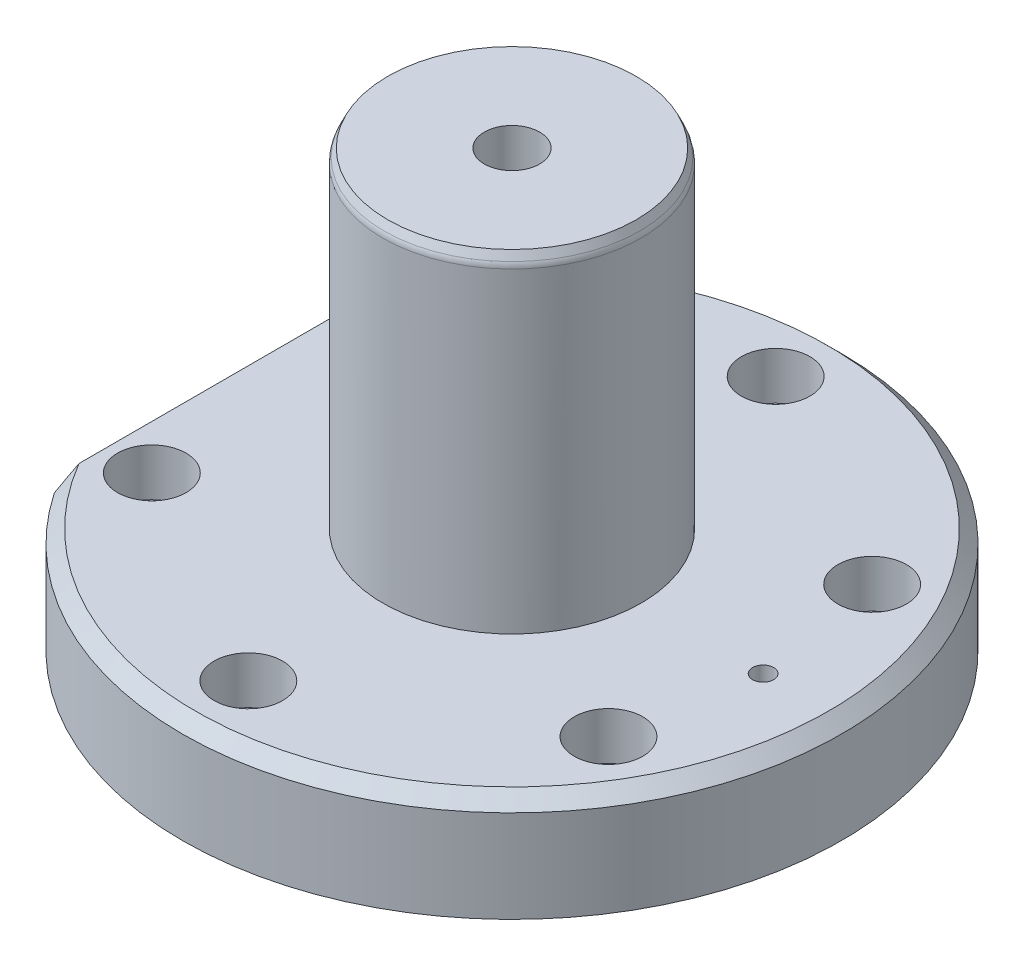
ISO-10303-21;
HEADER;
FILE_DESCRIPTION(('STEP AP214'),'2;1');
FILE_NAME('part.step','',(''),(''),'','','');
FILE_SCHEMA(('AUTOMOTIVE_DESIGN { 1 0 10303 214 1 1 1 1 }'));
ENDSEC;
DATA;
#1=APPLICATION_CONTEXT('core data for automotive mechanical design processes');
#2=APPLICATION_PROTOCOL_DEFINITION('international standard','automotive_design',2000,#1);
#3=PRODUCT_CONTEXT('',#1,'mechanical');
#4=PRODUCT('Part','Part','',(#3));
#5=PRODUCT_RELATED_PRODUCT_CATEGORY('part','',(#4));
#6=PRODUCT_DEFINITION_FORMATION('','',#4);
#7=PRODUCT_DEFINITION_CONTEXT('part definition',#1,'design');
#8=PRODUCT_DEFINITION('design','',#6,#7);
#9=PRODUCT_DEFINITION_SHAPE('','',#8);
#10=(LENGTH_UNIT() NAMED_UNIT(*) SI_UNIT(.MILLI.,.METRE.));
#11=(NAMED_UNIT(*) PLANE_ANGLE_UNIT() SI_UNIT($,.RADIAN.));
#12=(NAMED_UNIT(*) SI_UNIT($,.STERADIAN.) SOLID_ANGLE_UNIT());
#13=UNCERTAINTY_MEASURE_WITH_UNIT(LENGTH_MEASURE(1.E-05),#10,'distance_accuracy_value','');
#14=(GEOMETRIC_REPRESENTATION_CONTEXT(3) GLOBAL_UNCERTAINTY_ASSIGNED_CONTEXT((#13)) GLOBAL_UNIT_ASSIGNED_CONTEXT((#10,
#11,#12)) REPRESENTATION_CONTEXT('',''));
#15=CARTESIAN_POINT('',(0.,0.,0.));
#16=DIRECTION('',(0.,0.,1.));
#17=DIRECTION('',(1.,0.,0.));
#18=AXIS2_PLACEMENT_3D('',#15,#16,#17);
#19=CARTESIAN_POINT('',(0.,0.,0.));
#20=DIRECTION('',(0.,-1.,0.));
#21=DIRECTION('',(0.,0.,-1.));
#22=AXIS2_PLACEMENT_3D('',#19,#20,#21);
#23=CYLINDRICAL_SURFACE('',#22,125.);
#24=CARTESIAN_POINT('',(0.,50.,0.));
#25=DIRECTION('',(0.,-1.,0.));
#26=DIRECTION('',(0.,0.,-1.));
#27=AXIS2_PLACEMENT_3D('',#24,#25,#26);
#28=CIRCLE('',#27,125.);
#29=CARTESIAN_POINT('',(-103.5,50.,-70.0910122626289));
#30=VERTEX_POINT('',#29);
#31=CARTESIAN_POINT('',(-103.5,50.,70.0910122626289));
#32=VERTEX_POINT('',#31);
#33=EDGE_CURVE('E81',#30,#32,#28,.T.);
#34=ORIENTED_EDGE('',*,*,#33,.F.);
#35=DIRECTION('',(0.,-1.,0.));
#36=VECTOR('',#35,1.);
#37=CARTESIAN_POINT('',(-103.5,0.,-70.0910122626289));
#38=LINE('',#37,#36);
#39=CARTESIAN_POINT('',(-103.5,85.0000000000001,-70.0910122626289));
#40=VERTEX_POINT('',#39);
#41=EDGE_CURVE('E66',#30,#40,#38,.F.);
#42=ORIENTED_EDGE('',*,*,#41,.T.);
#43=CARTESIAN_POINT('',(0.,85.0000000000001,0.));
#44=DIRECTION('',(0.,1.,0.));
#45=DIRECTION('',(0.,0.,1.));
#46=AXIS2_PLACEMENT_3D('',#43,#44,#45);
#47=CIRCLE('',#46,125.);
#48=CARTESIAN_POINT('',(-103.5,85.0000000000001,70.0910122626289));
#49=VERTEX_POINT('',#48);
#50=EDGE_CURVE('E89',#40,#49,#47,.F.);
#51=ORIENTED_EDGE('',*,*,#50,.T.);
#52=DIRECTION('',(0.,-1.,0.));
#53=VECTOR('',#52,1.);
#54=CARTESIAN_POINT('',(-103.5,0.,70.0910122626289));
#55=LINE('',#54,#53);
#56=EDGE_CURVE('E48',#32,#49,#55,.F.);
#57=ORIENTED_EDGE('',*,*,#56,.F.);
#58=EDGE_LOOP('',(#34,#42,#51,#57));
#59=FACE_BOUND('',#58,.T.);
#60=ADVANCED_FACE('F33',(#59),#23,.T.);
#61=CARTESIAN_POINT('',(15.,50.,0.));
#62=DIRECTION('',(0.,-1.,0.));
#63=DIRECTION('',(0.,0.,-1.));
#64=AXIS2_PLACEMENT_3D('',#61,#62,#63);
#65=PLANE('',#64);
#66=CARTESIAN_POINT('',(86.6025403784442,50.,49.9999999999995));
#67=DIRECTION('',(0.,-1.,0.));
#68=DIRECTION('',(0.,0.,-1.));
#69=AXIS2_PLACEMENT_3D('',#66,#67,#68);
#70=CIRCLE('',#69,8.75);
#71=CARTESIAN_POINT('',(86.6025403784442,50.,41.2499999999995));
#72=VERTEX_POINT('',#71);
#73=EDGE_CURVE('E131',#72,#72,#70,.T.);
#74=ORIENTED_EDGE('',*,*,#73,.F.);
#75=EDGE_LOOP('',(#74));
#76=FACE_BOUND('',#75,.T.);
#77=CARTESIAN_POINT('',(-86.6025403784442,50.,49.9999999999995));
#78=DIRECTION('',(0.,-1.,0.));
#79=DIRECTION('',(0.,0.,-1.));
#80=AXIS2_PLACEMENT_3D('',#77,#78,#79);
#81=CIRCLE('',#80,8.75);
#82=CARTESIAN_POINT('',(-86.6025403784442,50.,41.2499999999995));
#83=VERTEX_POINT('',#82);
#84=EDGE_CURVE('E126',#83,#83,#81,.T.);
#85=ORIENTED_EDGE('',*,*,#84,.F.);
#86=EDGE_LOOP('',(#85));
#87=FACE_BOUND('',#86,.T.);
#88=CARTESIAN_POINT('',(-86.6025403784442,50.,-49.9999999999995));
#89=DIRECTION('',(0.,-1.,0.));
#90=DIRECTION('',(0.,0.,-1.));
#91=AXIS2_PLACEMENT_3D('',#88,#89,#90);
#92=CIRCLE('',#91,8.75);
#93=CARTESIAN_POINT('',(-86.6025403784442,50.,-58.7499999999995));
#94=VERTEX_POINT('',#93);
#95=EDGE_CURVE('E121',#94,#94,#92,.T.);
#96=ORIENTED_EDGE('',*,*,#95,.F.);
#97=EDGE_LOOP('',(#96));
#98=FACE_BOUND('',#97,.T.);
#99=CARTESIAN_POINT('',(86.6025403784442,50.,-49.9999999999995));
#100=DIRECTION('',(0.,-1.,0.));
#101=DIRECTION('',(0.,0.,-1.));
#102=AXIS2_PLACEMENT_3D('',#99,#100,#101);
#103=CIRCLE('',#102,8.75);
#104=CARTESIAN_POINT('',(86.6025403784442,50.,-58.7499999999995));
#105=VERTEX_POINT('',#104);
#106=EDGE_CURVE('E116',#105,#105,#103,.T.);
#107=ORIENTED_EDGE('',*,*,#106,.F.);
#108=EDGE_LOOP('',(#107));
#109=FACE_BOUND('',#108,.T.);
#110=CARTESIAN_POINT('',(0.,50.,-100.));
#111=DIRECTION('',(0.,-1.,0.));
#112=DIRECTION('',(0.,0.,-1.));
#113=AXIS2_PLACEMENT_3D('',#110,#111,#112);
#114=CIRCLE('',#113,8.75);
#115=CARTESIAN_POINT('',(0.,50.,-108.75));
#116=VERTEX_POINT('',#115);
#117=EDGE_CURVE('E111',#116,#116,#114,.T.);
#118=ORIENTED_EDGE('',*,*,#117,.F.);
#119=EDGE_LOOP('',(#118));
#120=FACE_BOUND('',#119,.T.);
#121=CARTESIAN_POINT('',(0.,50.,100.));
#122=DIRECTION('',(0.,-1.,0.));
#123=DIRECTION('',(0.,0.,-1.));
#124=AXIS2_PLACEMENT_3D('',#121,#122,#123);
#125=CIRCLE('',#124,8.75);
#126=CARTESIAN_POINT('',(0.,50.,91.25));
#127=VERTEX_POINT('',#126);
#128=EDGE_CURVE('E106',#127,#127,#125,.T.);
#129=ORIENTED_EDGE('',*,*,#128,.F.);
#130=EDGE_LOOP('',(#129));
#131=FACE_BOUND('',#130,.T.);
#132=CARTESIAN_POINT('',(95.25,50.,0.));
#133=DIRECTION('',(0.,-1.,0.));
#134=DIRECTION('',(0.,0.,-1.));
#135=AXIS2_PLACEMENT_3D('',#132,#133,#134);
#136=CIRCLE('',#135,3.99999999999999);
#137=CARTESIAN_POINT('',(95.25,50.,-3.99999999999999));
#138=VERTEX_POINT('',#137);
#139=EDGE_CURVE('E226',#138,#138,#136,.T.);
#140=ORIENTED_EDGE('',*,*,#139,.F.);
#141=EDGE_LOOP('',(#140));
#142=FACE_BOUND('',#141,.T.);
#143=CARTESIAN_POINT('',(0.,50.,0.));
#144=DIRECTION('',(0.,-1.,0.));
#145=DIRECTION('',(0.,0.,-1.));
#146=AXIS2_PLACEMENT_3D('',#143,#144,#145);
#147=CIRCLE('',#146,15.);
#148=CARTESIAN_POINT('',(0.,50.,-15.));
#149=VERTEX_POINT('',#148);
#150=EDGE_CURVE('E86',#149,#149,#147,.T.);
#151=ORIENTED_EDGE('',*,*,#150,.F.);
#152=EDGE_LOOP('',(#151));
#153=FACE_BOUND('',#152,.T.);
#154=ORIENTED_EDGE('',*,*,#33,.T.);
#155=DIRECTION('',(0.,0.,-1.));
#156=VECTOR('',#155,1.);
#157=CARTESIAN_POINT('',(-103.5,50.,125.001));
#158=LINE('',#157,#156);
#159=EDGE_CURVE('E69',#32,#30,#158,.T.);
#160=ORIENTED_EDGE('',*,*,#159,.T.);
#161=EDGE_LOOP('',(#154,#160));
#162=FACE_BOUND('',#161,.T.);
#163=ADVANCED_FACE('F80',(#76,#87,#98,#109,#120,#131,#142,#153,#162),#65,.T.);
#164=CARTESIAN_POINT('',(48.9999999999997,90.,0.));
#165=DIRECTION('',(0.,1.,0.));
#166=DIRECTION('',(0.,0.,1.));
#167=AXIS2_PLACEMENT_3D('',#164,#165,#166);
#168=PLANE('',#167);
#169=CARTESIAN_POINT('',(86.6025403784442,90.,49.9999999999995));
#170=DIRECTION('',(0.,1.,0.));
#171=DIRECTION('',(0.,0.,1.));
#172=AXIS2_PLACEMENT_3D('',#169,#170,#171);
#173=CIRCLE('',#172,13.);
#174=CARTESIAN_POINT('',(86.6025403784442,90.,62.9999999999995));
#175=VERTEX_POINT('',#174);
#176=EDGE_CURVE('E312',#175,#175,#173,.T.);
#177=ORIENTED_EDGE('',*,*,#176,.F.);
#178=EDGE_LOOP('',(#177));
#179=FACE_BOUND('',#178,.T.);
#180=CARTESIAN_POINT('',(-86.6025403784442,90.,49.9999999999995));
#181=DIRECTION('',(0.,1.,0.));
#182=DIRECTION('',(0.,0.,1.));
#183=AXIS2_PLACEMENT_3D('',#180,#181,#182);
#184=CIRCLE('',#183,13.);
#185=CARTESIAN_POINT('',(-86.6025403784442,90.,62.9999999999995));
#186=VERTEX_POINT('',#185);
#187=EDGE_CURVE('E133',#186,#186,#184,.T.);
#188=ORIENTED_EDGE('',*,*,#187,.F.);
#189=EDGE_LOOP('',(#188));
#190=FACE_BOUND('',#189,.T.);
#191=CARTESIAN_POINT('',(-86.6025403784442,90.,-49.9999999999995));
#192=DIRECTION('',(0.,1.,0.));
#193=DIRECTION('',(0.,0.,1.));
#194=AXIS2_PLACEMENT_3D('',#191,#192,#193);
#195=CIRCLE('',#194,13.);
#196=CARTESIAN_POINT('',(-86.6025403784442,90.,-36.9999999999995));
#197=VERTEX_POINT('',#196);
#198=EDGE_CURVE('E129',#197,#197,#195,.T.);
#199=ORIENTED_EDGE('',*,*,#198,.F.);
#200=EDGE_LOOP('',(#199));
#201=FACE_BOUND('',#200,.T.);
#202=CARTESIAN_POINT('',(86.6025403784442,90.,-49.9999999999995));
#203=DIRECTION('',(0.,1.,0.));
#204=DIRECTION('',(0.,0.,1.));
#205=AXIS2_PLACEMENT_3D('',#202,#203,#204);
#206=CIRCLE('',#205,13.);
#207=CARTESIAN_POINT('',(86.6025403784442,90.,-36.9999999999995));
#208=VERTEX_POINT('',#207);
#209=EDGE_CURVE('E124',#208,#208,#206,.T.);
#210=ORIENTED_EDGE('',*,*,#209,.F.);
#211=EDGE_LOOP('',(#210));
#212=FACE_BOUND('',#211,.T.);
#213=CARTESIAN_POINT('',(0.,90.,-100.));
#214=DIRECTION('',(0.,1.,0.));
#215=DIRECTION('',(0.,0.,1.));
#216=AXIS2_PLACEMENT_3D('',#213,#214,#215);
#217=CIRCLE('',#216,13.);
#218=CARTESIAN_POINT('',(0.,90.,-87.));
#219=VERTEX_POINT('',#218);
#220=EDGE_CURVE('E119',#219,#219,#217,.T.);
#221=ORIENTED_EDGE('',*,*,#220,.F.);
#222=EDGE_LOOP('',(#221));
#223=FACE_BOUND('',#222,.T.);
#224=CARTESIAN_POINT('',(0.,90.,100.));
#225=DIRECTION('',(0.,1.,0.));
#226=DIRECTION('',(0.,0.,1.));
#227=AXIS2_PLACEMENT_3D('',#224,#225,#226);
#228=CIRCLE('',#227,13.);
#229=CARTESIAN_POINT('',(0.,90.,113.));
#230=VERTEX_POINT('',#229);
#231=EDGE_CURVE('E114',#230,#230,#228,.T.);
#232=ORIENTED_EDGE('',*,*,#231,.F.);
#233=EDGE_LOOP('',(#232));
#234=FACE_BOUND('',#233,.T.);
#235=CARTESIAN_POINT('',(95.25,90.,0.));
#236=DIRECTION('',(0.,1.,0.));
#237=DIRECTION('',(0.,0.,1.));
#238=AXIS2_PLACEMENT_3D('',#235,#236,#237);
#239=CIRCLE('',#238,3.99999999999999);
#240=CARTESIAN_POINT('',(95.25,90.,3.99999999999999));
#241=VERTEX_POINT('',#240);
#242=EDGE_CURVE('E109',#241,#241,#239,.T.);
#243=ORIENTED_EDGE('',*,*,#242,.F.);
#244=EDGE_LOOP('',(#243));
#245=FACE_BOUND('',#244,.T.);
#246=CARTESIAN_POINT('',(0.,90.,0.));
#247=DIRECTION('',(0.,-1.,0.));
#248=DIRECTION('',(0.,0.,-1.));
#249=AXIS2_PLACEMENT_3D('',#246,#247,#248);
#250=CIRCLE('',#249,48.9999999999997);
#251=CARTESIAN_POINT('',(0.,90.,-48.9999999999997));
#252=VERTEX_POINT('',#251);
#253=EDGE_CURVE('E92',#252,#252,#250,.T.);
#254=ORIENTED_EDGE('',*,*,#253,.T.);
#255=EDGE_LOOP('',(#254));
#256=FACE_BOUND('',#255,.T.);
#257=CARTESIAN_POINT('',(0.,90.,0.));
#258=DIRECTION('',(0.,1.,0.));
#259=DIRECTION('',(0.,0.,1.));
#260=AXIS2_PLACEMENT_3D('',#257,#258,#259);
#261=CIRCLE('',#260,120.);
#262=CARTESIAN_POINT('',(-103.5,90.,60.7268474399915));
#263=VERTEX_POINT('',#262);
#264=CARTESIAN_POINT('',(-103.5,90.,-60.7268474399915));
#265=VERTEX_POINT('',#264);
#266=EDGE_CURVE('E97',#263,#265,#261,.T.);
#267=ORIENTED_EDGE('',*,*,#266,.T.);
#268=DIRECTION('',(0.,0.,-1.));
#269=VECTOR('',#268,1.);
#270=CARTESIAN_POINT('',(-103.5,90.,125.001));
#271=LINE('',#270,#269);
#272=EDGE_CURVE('E83',#263,#265,#271,.T.);
#273=ORIENTED_EDGE('',*,*,#272,.F.);
#274=EDGE_LOOP('',(#267,#273));
#275=FACE_BOUND('',#274,.T.);
#276=ADVANCED_FACE('F156',(#179,#190,#201,#212,#223,#234,#245,#256,#275),#168,.T.);
#277=CARTESIAN_POINT('',(0.,85.0000000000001,0.));
#278=DIRECTION('',(0.,-1.,0.));
#279=DIRECTION('',(0.,0.,-1.));
#280=AXIS2_PLACEMENT_3D('',#277,#278,#279);
#281=CONICAL_SURFACE('',#280,125.,0.785398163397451);
#282=ORIENTED_EDGE('',*,*,#50,.F.);
#283=CARTESIAN_POINT('',(-103.5,9.93982398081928,-171.206962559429));
#284=CARTESIAN_POINT('',(-103.5,11.0354276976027,-169.926714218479));
#285=CARTESIAN_POINT('',(-103.5,12.1291371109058,-168.644845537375));
#286=CARTESIAN_POINT('',(-103.5,14.3125241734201,-166.07767532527));
#287=CARTESIAN_POINT('',(-103.5,15.4022018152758,-164.792373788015));
#288=CARTESIAN_POINT('',(-103.5,18.6648538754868,-160.930994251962));
#289=CARTESIAN_POINT('',(-103.5,20.8314096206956,-158.349485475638));
#290=CARTESIAN_POINT('',(-103.5,25.146214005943,-153.168953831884));
#291=CARTESIAN_POINT('',(-103.5,27.2944526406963,-150.569922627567));
#292=CARTESIAN_POINT('',(-103.5,31.5687519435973,-145.35369083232));
#293=CARTESIAN_POINT('',(-103.5,33.6948127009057,-142.736490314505));
#294=CARTESIAN_POINT('',(-103.5,37.9796856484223,-137.409287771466));
#295=CARTESIAN_POINT('',(-103.5,40.1377882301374,-134.698714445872));
#296=CARTESIAN_POINT('',(-103.5,44.4228928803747,-129.25305512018));
#297=CARTESIAN_POINT('',(-103.5,46.5498948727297,-126.517969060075));
#298=CARTESIAN_POINT('',(-103.5,50.7670802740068,-121.020582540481));
#299=CARTESIAN_POINT('',(-103.5,52.8572724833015,-118.25828883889));
#300=CARTESIAN_POINT('',(-103.5,56.9950266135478,-112.701873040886));
#301=CARTESIAN_POINT('',(-103.5,59.0425885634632,-109.9077509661));
#302=CARTESIAN_POINT('',(-103.5,62.0777978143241,-105.686726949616));
#303=CARTESIAN_POINT('',(-103.5,63.0844116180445,-104.27344553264));
#304=CARTESIAN_POINT('',(-103.5,65.0837435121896,-101.437093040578));
#305=CARTESIAN_POINT('',(-103.5,66.0764617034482,-100.014022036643));
#306=CARTESIAN_POINT('',(-103.5,68.0467250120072,-97.157356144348));
#307=CARTESIAN_POINT('',(-103.5,69.0242697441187,-95.7237609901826));
#308=CARTESIAN_POINT('',(-103.5,70.9626776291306,-92.8453500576));
#309=CARTESIAN_POINT('',(-103.5,71.9235409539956,-91.4005343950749));
#310=CARTESIAN_POINT('',(-103.5,73.8278097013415,-88.4975524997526));
#311=CARTESIAN_POINT('',(-103.5,74.7711984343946,-87.0393753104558));
#312=CARTESIAN_POINT('',(-103.5,76.6377542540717,-84.1101227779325));
#313=CARTESIAN_POINT('',(-103.5,77.5609213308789,-82.6390474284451));
#314=CARTESIAN_POINT('',(-103.5,79.3849245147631,-79.6831260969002));
#315=CARTESIAN_POINT('',(-103.5,80.2857608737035,-78.1982802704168));
#316=CARTESIAN_POINT('',(-103.5,82.0627504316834,-75.2138757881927));
#317=CARTESIAN_POINT('',(-103.5,82.9389036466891,-73.7143171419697));
#318=CARTESIAN_POINT('',(-103.5,84.6550490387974,-70.7149488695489));
#319=CARTESIAN_POINT('',(-103.5,85.4953193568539,-69.2152985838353));
#320=CARTESIAN_POINT('',(-103.5,87.1461793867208,-66.1997232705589));
#321=CARTESIAN_POINT('',(-103.5,87.956769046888,-64.6837982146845));
#322=CARTESIAN_POINT('',(-103.5,89.5451369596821,-61.6345519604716));
#323=CARTESIAN_POINT('',(-103.5,90.3229105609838,-60.1012283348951));
#324=CARTESIAN_POINT('',(-103.5,91.8418990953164,-57.0165660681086));
#325=CARTESIAN_POINT('',(-103.5,92.5831142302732,-55.4652275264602));
#326=CARTESIAN_POINT('',(-103.5,94.0238514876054,-52.3462211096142));
#327=CARTESIAN_POINT('',(-103.5,94.7234379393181,-50.7785830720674));
#328=CARTESIAN_POINT('',(-103.5,96.0777628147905,-47.6241078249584));
#329=CARTESIAN_POINT('',(-103.5,96.7325002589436,-46.0372701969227));
#330=CARTESIAN_POINT('',(-103.5,98.6219493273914,-41.2482988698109));
#331=CARTESIAN_POINT('',(-103.5,99.7826483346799,-38.0161033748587));
#332=CARTESIAN_POINT('',(-103.5,101.358924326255,-33.0632521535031));
#333=CARTESIAN_POINT('',(-103.5,101.862735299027,-31.370324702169));
#334=CARTESIAN_POINT('',(-103.5,102.800982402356,-27.9652841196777));
#335=CARTESIAN_POINT('',(-103.5,103.23542196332,-26.2531719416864));
#336=CARTESIAN_POINT('',(-103.5,104.029154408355,-22.8116878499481));
#337=CARTESIAN_POINT('',(-103.5,104.388452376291,-21.0823171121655));
#338=CARTESIAN_POINT('',(-103.5,105.026656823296,-17.6087184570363));
#339=CARTESIAN_POINT('',(-103.5,105.305562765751,-15.864490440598));
#340=CARTESIAN_POINT('',(-103.5,105.777466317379,-12.3720248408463));
#341=CARTESIAN_POINT('',(-103.5,105.970827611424,-10.6238366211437));
#342=CARTESIAN_POINT('',(-103.5,106.270075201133,-7.11996410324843));
#343=CARTESIAN_POINT('',(-103.5,106.375962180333,-5.36427986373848));
#344=CARTESIAN_POINT('',(-103.5,106.498366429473,-1.84985549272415));
#345=CARTESIAN_POINT('',(-103.5,106.514887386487,-0.0911154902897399));
#346=CARTESIAN_POINT('',(-103.5,106.458268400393,3.42491585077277));
#347=CARTESIAN_POINT('',(-103.5,106.385128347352,5.18220718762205));
#348=CARTESIAN_POINT('',(-103.5,106.150865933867,8.68551417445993));
#349=CARTESIAN_POINT('',(-103.5,105.990011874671,10.4315478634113));
#350=CARTESIAN_POINT('',(-103.5,105.583290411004,13.9136430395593));
#351=CARTESIAN_POINT('',(-103.5,105.337422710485,15.6497044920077));
#352=CARTESIAN_POINT('',(-103.5,104.764649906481,19.1086027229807));
#353=CARTESIAN_POINT('',(-103.5,104.437733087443,20.8314375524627));
#354=CARTESIAN_POINT('',(-103.5,103.707802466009,24.2608467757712));
#355=CARTESIAN_POINT('',(-103.5,103.304788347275,25.9674211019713));
#356=CARTESIAN_POINT('',(-103.5,102.4247034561,29.3756078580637));
#357=CARTESIAN_POINT('',(-103.5,101.947075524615,31.0770758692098));
#358=CARTESIAN_POINT('',(-103.5,100.925940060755,34.4601453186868));
#359=CARTESIAN_POINT('',(-103.5,100.38242919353,36.1417457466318));
#360=CARTESIAN_POINT('',(-103.5,99.2354635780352,39.4841306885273));
#361=CARTESIAN_POINT('',(-103.5,98.6320147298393,41.1449172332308));
#362=CARTESIAN_POINT('',(-103.5,97.370798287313,44.4456183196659));
#363=CARTESIAN_POINT('',(-103.5,96.7130317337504,46.0855332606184));
#364=CARTESIAN_POINT('',(-103.5,95.0356924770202,50.0919391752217));
#365=CARTESIAN_POINT('',(-103.5,93.9884913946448,52.4468747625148));
#366=CARTESIAN_POINT('',(-103.5,91.8049605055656,57.1145562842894));
#367=CARTESIAN_POINT('',(-103.5,90.6686393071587,59.4273062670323));
#368=CARTESIAN_POINT('',(-103.5,88.9154848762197,62.8502215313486));
#369=CARTESIAN_POINT('',(-103.5,88.3275312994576,63.975300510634));
#370=CARTESIAN_POINT('',(-103.5,87.1344186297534,66.2163195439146));
#371=CARTESIAN_POINT('',(-103.5,86.5292594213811,67.3322595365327));
#372=CARTESIAN_POINT('',(-103.5,85.3031627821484,69.5550907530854));
#373=CARTESIAN_POINT('',(-103.5,84.682228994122,70.6619839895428));
#374=CARTESIAN_POINT('',(-103.5,83.4256114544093,72.8673163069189));
#375=CARTESIAN_POINT('',(-103.5,82.7899282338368,73.9657556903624));
#376=CARTESIAN_POINT('',(-103.5,82.1474285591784,75.0601760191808));
#377=B_SPLINE_CURVE_WITH_KNOTS('',3,(#283,#284,#285,#286,#287,#288,#289,#290,#291,#292,#293,
#294,#295,#296,#297,#298,#299,#300,#301,#302,#303,#304,#305,#306,#307,#308,#309,#310,#311,#312,
#313,#314,#315,#316,#317,#318,#319,#320,#321,#322,#323,#324,#325,#326,#327,#328,#329,#330,#331,
#332,#333,#334,#335,#336,#337,#338,#339,#340,#341,#342,#343,#344,#345,#346,#347,#348,#349,#350,
#351,#352,#353,#354,#355,#356,#357,#358,#359,#360,#361,#362,#363,#364,#365,#366,#367,#368,#369,
#370,#371,#372,#373,#374,#375,#376),.UNSPECIFIED.,.F.,.F.,(4,2,2,2,2,2,2,2,2,2,2,2,2,2,2,2,2,2,
2,2,2,2,2,2,2,2,2,2,2,2,2,2,2,2,2,2,2,2,2,2,2,2,2,2,2,2,4),(0.,5.05513739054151,
10.1102839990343,20.2207515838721,30.336427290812,40.4520623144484,50.8461702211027,
61.2403035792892,71.6319172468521,82.0235238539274,87.2288110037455,92.434060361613,
97.639441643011,102.844769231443,108.054835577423,113.264904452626,118.474914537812,
123.684921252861,128.841656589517,133.998400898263,139.155873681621,144.313317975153,
149.462573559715,154.611941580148,164.905374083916,170.203122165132,175.500608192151,
180.797735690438,186.094898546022,191.369319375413,196.643698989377,201.917860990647,
207.192029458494,212.450154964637,217.708298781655,222.96720310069,228.226129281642,
233.526388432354,238.826915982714,244.126922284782,249.426827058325,257.156355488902,
264.885138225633,268.6933547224,272.501596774,276.308967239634,280.116200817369),.UNSPECIFIED.);
#378=EDGE_CURVE('E71',#40,#265,#377,.T.);
#379=ORIENTED_EDGE('',*,*,#378,.T.);
#380=ORIENTED_EDGE('',*,*,#266,.F.);
#381=CARTESIAN_POINT('',(-103.5,9.93982398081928,171.206962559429));
#382=CARTESIAN_POINT('',(-103.5,11.0354276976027,169.926714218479));
#383=CARTESIAN_POINT('',(-103.5,12.1291371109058,168.644845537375));
#384=CARTESIAN_POINT('',(-103.5,14.3125241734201,166.07767532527));
#385=CARTESIAN_POINT('',(-103.5,15.4022018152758,164.792373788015));
#386=CARTESIAN_POINT('',(-103.5,18.6648538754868,160.930994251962));
#387=CARTESIAN_POINT('',(-103.5,20.8314096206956,158.349485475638));
#388=CARTESIAN_POINT('',(-103.5,25.146214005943,153.168953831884));
#389=CARTESIAN_POINT('',(-103.5,27.2944526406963,150.569922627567));
#390=CARTESIAN_POINT('',(-103.5,31.5687519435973,145.35369083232));
#391=CARTESIAN_POINT('',(-103.5,33.6948127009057,142.736490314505));
#392=CARTESIAN_POINT('',(-103.5,37.9796856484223,137.409287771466));
#393=CARTESIAN_POINT('',(-103.5,40.1377882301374,134.698714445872));
#394=CARTESIAN_POINT('',(-103.5,44.4228928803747,129.25305512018));
#395=CARTESIAN_POINT('',(-103.5,46.5498948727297,126.517969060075));
#396=CARTESIAN_POINT('',(-103.5,50.7670802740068,121.020582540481));
#397=CARTESIAN_POINT('',(-103.5,52.8572724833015,118.25828883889));
#398=CARTESIAN_POINT('',(-103.5,56.9950266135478,112.701873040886));
#399=CARTESIAN_POINT('',(-103.5,59.0425885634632,109.9077509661));
#400=CARTESIAN_POINT('',(-103.5,62.0777978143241,105.686726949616));
#401=CARTESIAN_POINT('',(-103.5,63.0844116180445,104.27344553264));
#402=CARTESIAN_POINT('',(-103.5,65.0837435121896,101.437093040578));
#403=CARTESIAN_POINT('',(-103.5,66.0764617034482,100.014022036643));
#404=CARTESIAN_POINT('',(-103.5,68.0467250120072,97.157356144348));
#405=CARTESIAN_POINT('',(-103.5,69.0242697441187,95.7237609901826));
#406=CARTESIAN_POINT('',(-103.5,70.9626776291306,92.8453500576));
#407=CARTESIAN_POINT('',(-103.5,71.9235409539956,91.4005343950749));
#408=CARTESIAN_POINT('',(-103.5,73.8278097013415,88.4975524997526));
#409=CARTESIAN_POINT('',(-103.5,74.7711984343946,87.0393753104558));
#410=CARTESIAN_POINT('',(-103.5,76.6377542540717,84.1101227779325));
#411=CARTESIAN_POINT('',(-103.5,77.5609213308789,82.6390474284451));
#412=CARTESIAN_POINT('',(-103.5,79.3849245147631,79.6831260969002));
#413=CARTESIAN_POINT('',(-103.5,80.2857608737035,78.1982802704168));
#414=CARTESIAN_POINT('',(-103.5,82.0627504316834,75.2138757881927));
#415=CARTESIAN_POINT('',(-103.5,82.9389036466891,73.7143171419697));
#416=CARTESIAN_POINT('',(-103.5,84.6550490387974,70.7149488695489));
#417=CARTESIAN_POINT('',(-103.5,85.4953193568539,69.2152985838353));
#418=CARTESIAN_POINT('',(-103.5,87.1461793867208,66.1997232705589));
#419=CARTESIAN_POINT('',(-103.5,87.956769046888,64.6837982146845));
#420=CARTESIAN_POINT('',(-103.5,89.5451369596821,61.6345519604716));
#421=CARTESIAN_POINT('',(-103.5,90.3229105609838,60.1012283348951));
#422=CARTESIAN_POINT('',(-103.5,91.8418990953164,57.0165660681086));
#423=CARTESIAN_POINT('',(-103.5,92.5831142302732,55.4652275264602));
#424=CARTESIAN_POINT('',(-103.5,94.0238514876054,52.3462211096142));
#425=CARTESIAN_POINT('',(-103.5,94.7234379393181,50.7785830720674));
#426=CARTESIAN_POINT('',(-103.5,96.0777628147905,47.6241078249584));
#427=CARTESIAN_POINT('',(-103.5,96.7325002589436,46.0372701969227));
#428=CARTESIAN_POINT('',(-103.5,98.6219493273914,41.2482988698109));
#429=CARTESIAN_POINT('',(-103.5,99.7826483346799,38.0161033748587));
#430=CARTESIAN_POINT('',(-103.5,101.358924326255,33.0632521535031));
#431=CARTESIAN_POINT('',(-103.5,101.862735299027,31.370324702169));
#432=CARTESIAN_POINT('',(-103.5,102.800982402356,27.9652841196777));
#433=CARTESIAN_POINT('',(-103.5,103.23542196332,26.2531719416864));
#434=CARTESIAN_POINT('',(-103.5,104.029154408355,22.8116878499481));
#435=CARTESIAN_POINT('',(-103.5,104.388452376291,21.0823171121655));
#436=CARTESIAN_POINT('',(-103.5,105.026656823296,17.6087184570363));
#437=CARTESIAN_POINT('',(-103.5,105.305562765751,15.864490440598));
#438=CARTESIAN_POINT('',(-103.5,105.777466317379,12.3720248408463));
#439=CARTESIAN_POINT('',(-103.5,105.970827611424,10.6238366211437));
#440=CARTESIAN_POINT('',(-103.5,106.270075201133,7.11996410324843));
#441=CARTESIAN_POINT('',(-103.5,106.375962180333,5.36427986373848));
#442=CARTESIAN_POINT('',(-103.5,106.498366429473,1.84985549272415));
#443=CARTESIAN_POINT('',(-103.5,106.514887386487,0.0911154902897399));
#444=CARTESIAN_POINT('',(-103.5,106.458268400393,-3.42491585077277));
#445=CARTESIAN_POINT('',(-103.5,106.385128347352,-5.18220718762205));
#446=CARTESIAN_POINT('',(-103.5,106.150865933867,-8.68551417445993));
#447=CARTESIAN_POINT('',(-103.5,105.990011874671,-10.4315478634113));
#448=CARTESIAN_POINT('',(-103.5,105.583290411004,-13.9136430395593));
#449=CARTESIAN_POINT('',(-103.5,105.337422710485,-15.6497044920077));
#450=CARTESIAN_POINT('',(-103.5,104.764649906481,-19.1086027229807));
#451=CARTESIAN_POINT('',(-103.5,104.437733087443,-20.8314375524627));
#452=CARTESIAN_POINT('',(-103.5,103.707802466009,-24.2608467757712));
#453=CARTESIAN_POINT('',(-103.5,103.304788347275,-25.9674211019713));
#454=CARTESIAN_POINT('',(-103.5,102.4247034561,-29.3756078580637));
#455=CARTESIAN_POINT('',(-103.5,101.947075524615,-31.0770758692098));
#456=CARTESIAN_POINT('',(-103.5,100.925940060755,-34.4601453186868));
#457=CARTESIAN_POINT('',(-103.5,100.38242919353,-36.1417457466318));
#458=CARTESIAN_POINT('',(-103.5,99.2354635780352,-39.4841306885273));
#459=CARTESIAN_POINT('',(-103.5,98.6320147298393,-41.1449172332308));
#460=CARTESIAN_POINT('',(-103.5,97.370798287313,-44.4456183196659));
#461=CARTESIAN_POINT('',(-103.5,96.7130317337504,-46.0855332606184));
#462=CARTESIAN_POINT('',(-103.5,95.0356924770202,-50.0919391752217));
#463=CARTESIAN_POINT('',(-103.5,93.9884913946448,-52.4468747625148));
#464=CARTESIAN_POINT('',(-103.5,91.8049605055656,-57.1145562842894));
#465=CARTESIAN_POINT('',(-103.5,90.6686393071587,-59.4273062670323));
#466=CARTESIAN_POINT('',(-103.5,88.9154848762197,-62.8502215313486));
#467=CARTESIAN_POINT('',(-103.5,88.3275312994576,-63.975300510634));
#468=CARTESIAN_POINT('',(-103.5,87.1344186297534,-66.2163195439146));
#469=CARTESIAN_POINT('',(-103.5,86.5292594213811,-67.3322595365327));
#470=CARTESIAN_POINT('',(-103.5,85.3031627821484,-69.5550907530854));
#471=CARTESIAN_POINT('',(-103.5,84.682228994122,-70.6619839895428));
#472=CARTESIAN_POINT('',(-103.5,83.4256114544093,-72.8673163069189));
#473=CARTESIAN_POINT('',(-103.5,82.7899282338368,-73.9657556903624));
#474=CARTESIAN_POINT('',(-103.5,82.1474285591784,-75.0601760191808));
#475=B_SPLINE_CURVE_WITH_KNOTS('',3,(#381,#382,#383,#384,#385,#386,#387,#388,#389,#390,#391,
#392,#393,#394,#395,#396,#397,#398,#399,#400,#401,#402,#403,#404,#405,#406,#407,#408,#409,#410,
#411,#412,#413,#414,#415,#416,#417,#418,#419,#420,#421,#422,#423,#424,#425,#426,#427,#428,#429,
#430,#431,#432,#433,#434,#435,#436,#437,#438,#439,#440,#441,#442,#443,#444,#445,#446,#447,#448,
#449,#450,#451,#452,#453,#454,#455,#456,#457,#458,#459,#460,#461,#462,#463,#464,#465,#466,#467,
#468,#469,#470,#471,#472,#473,#474),.UNSPECIFIED.,.F.,.F.,(4,2,2,2,2,2,2,2,2,2,2,2,2,2,2,2,2,2,
2,2,2,2,2,2,2,2,2,2,2,2,2,2,2,2,2,2,2,2,2,2,2,2,2,2,2,2,4),(0.,5.05513739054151,
10.1102839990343,20.2207515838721,30.336427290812,40.4520623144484,50.8461702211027,
61.2403035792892,71.6319172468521,82.0235238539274,87.2288110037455,92.434060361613,
97.639441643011,102.844769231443,108.054835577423,113.264904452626,118.474914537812,
123.684921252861,128.841656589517,133.998400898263,139.155873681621,144.313317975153,
149.462573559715,154.611941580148,164.905374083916,170.203122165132,175.500608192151,
180.797735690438,186.094898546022,191.369319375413,196.643698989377,201.917860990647,
207.192029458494,212.450154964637,217.708298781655,222.96720310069,228.226129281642,
233.526388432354,238.826915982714,244.126922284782,249.426827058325,257.156355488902,
264.885138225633,268.6933547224,272.501596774,276.308967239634,280.116200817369),.UNSPECIFIED.);
#476=EDGE_CURVE('E76',#49,#263,#475,.T.);
#477=ORIENTED_EDGE('',*,*,#476,.F.);
#478=EDGE_LOOP('',(#282,#379,#380,#477));
#479=FACE_BOUND('',#478,.T.);
#480=ADVANCED_FACE('F166',(#479),#281,.T.);
#481=CARTESIAN_POINT('',(0.,0.,0.));
#482=DIRECTION('',(0.,-1.,0.));
#483=DIRECTION('',(0.,0.,-1.));
#484=AXIS2_PLACEMENT_3D('',#481,#482,#483);
#485=CYLINDRICAL_SURFACE('',#484,15.);
#486=CARTESIAN_POINT('',(0.,43.0000000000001,0.));
#487=DIRECTION('',(0.,-1.,0.));
#488=DIRECTION('',(0.,0.,-1.));
#489=AXIS2_PLACEMENT_3D('',#486,#487,#488);
#490=CIRCLE('',#489,15.);
#491=CARTESIAN_POINT('',(0.,43.0000000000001,15.));
#492=VERTEX_POINT('',#491);
#493=EDGE_CURVE('E103',#492,#492,#490,.F.);
#494=ORIENTED_EDGE('',*,*,#493,.T.);
#495=EDGE_LOOP('',(#494));
#496=FACE_BOUND('',#495,.T.);
#497=ORIENTED_EDGE('',*,*,#150,.T.);
#498=EDGE_LOOP('',(#497));
#499=FACE_BOUND('',#498,.T.);
#500=ADVANCED_FACE('F168',(#496,#499),#485,.T.);
#501=CARTESIAN_POINT('',(15.,40.,0.));
#502=DIRECTION('',(0.,-1.,0.));
#503=DIRECTION('',(0.,0.,-1.));
#504=AXIS2_PLACEMENT_3D('',#501,#502,#503);
#505=PLANE('',#504);
#506=CARTESIAN_POINT('',(0.,40.,0.));
#507=DIRECTION('',(0.,-1.,0.));
#508=DIRECTION('',(0.,0.,-1.));
#509=AXIS2_PLACEMENT_3D('',#506,#507,#508);
#510=CIRCLE('',#509,13.2679491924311);
#511=CARTESIAN_POINT('',(0.,40.,13.2679491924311));
#512=VERTEX_POINT('',#511);
#513=EDGE_CURVE('E100',#512,#512,#510,.T.);
#514=ORIENTED_EDGE('',*,*,#513,.T.);
#515=EDGE_LOOP('',(#514));
#516=FACE_BOUND('',#515,.T.);
#517=ADVANCED_FACE('F182',(#516),#505,.T.);
#518=CARTESIAN_POINT('',(0.,215.,0.));
#519=DIRECTION('',(0.,1.,0.));
#520=DIRECTION('',(0.,0.,1.));
#521=AXIS2_PLACEMENT_3D('',#518,#519,#520);
#522=PLANE('',#521);
#523=CARTESIAN_POINT('',(0.,215.,0.));
#524=DIRECTION('',(0.,1.,0.));
#525=DIRECTION('',(0.,0.,1.));
#526=AXIS2_PLACEMENT_3D('',#523,#524,#525);
#527=CIRCLE('',#526,10.5);
#528=CARTESIAN_POINT('',(0.,215.,10.5));
#529=VERTEX_POINT('',#528);
#530=EDGE_CURVE('E82',#529,#529,#527,.T.);
#531=ORIENTED_EDGE('',*,*,#530,.F.);
#532=EDGE_LOOP('',(#531));
#533=FACE_BOUND('',#532,.T.);
#534=CARTESIAN_POINT('',(0.,215.,0.));
#535=DIRECTION('',(0.,1.,0.));
#536=DIRECTION('',(0.,0.,1.));
#537=AXIS2_PLACEMENT_3D('',#534,#535,#536);
#538=CIRCLE('',#537,47.1347693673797);
#539=CARTESIAN_POINT('',(0.,215.,47.1347693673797));
#540=VERTEX_POINT('',#539);
#541=EDGE_CURVE('E85',#540,#540,#538,.T.);
#542=ORIENTED_EDGE('',*,*,#541,.T.);
#543=EDGE_LOOP('',(#542));
#544=FACE_BOUND('',#543,.T.);
#545=ADVANCED_FACE('F184',(#533,#544),#522,.T.);
#546=CARTESIAN_POINT('',(0.,0.,0.));
#547=DIRECTION('',(0.,-1.,0.));
#548=DIRECTION('',(0.,0.,-1.));
#549=AXIS2_PLACEMENT_3D('',#546,#547,#548);
#550=CYLINDRICAL_SURFACE('',#549,48.9999999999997);
#551=CARTESIAN_POINT('',(0.,209.891526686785,0.));
#552=DIRECTION('',(0.,1.,0.));
#553=DIRECTION('',(0.,0.,1.));
#554=AXIS2_PLACEMENT_3D('',#551,#552,#553);
#555=CIRCLE('',#554,48.9999999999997);
#556=CARTESIAN_POINT('',(0.,209.891526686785,48.9999999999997));
#557=VERTEX_POINT('',#556);
#558=EDGE_CURVE('E41',#557,#557,#555,.F.);
#559=ORIENTED_EDGE('',*,*,#558,.T.);
#560=EDGE_LOOP('',(#559));
#561=FACE_BOUND('',#560,.T.);
#562=ORIENTED_EDGE('',*,*,#253,.F.);
#563=EDGE_LOOP('',(#562));
#564=FACE_BOUND('',#563,.T.);
#565=ADVANCED_FACE('F138',(#561,#564),#550,.T.);
#566=CARTESIAN_POINT('',(0.,211.,0.));
#567=DIRECTION('',(0.,-1.,0.));
#568=DIRECTION('',(0.,0.,-1.));
#569=AXIS2_PLACEMENT_3D('',#566,#567,#568);
#570=CONICAL_SURFACE('',#569,48.9999999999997,0.436332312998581);
#571=CARTESIAN_POINT('',(0.,212.004617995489,0.));
#572=DIRECTION('',(0.,1.,0.));
#573=DIRECTION('',(0.,0.,1.));
#574=AXIS2_PLACEMENT_3D('',#571,#572,#573);
#575=CIRCLE('',#574,48.531538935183);
#576=CARTESIAN_POINT('',(0.,212.004617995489,48.531538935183));
#577=VERTEX_POINT('',#576);
#578=EDGE_CURVE('E11',#577,#577,#575,.T.);
#579=ORIENTED_EDGE('',*,*,#578,.T.);
#580=EDGE_LOOP('',(#579));
#581=FACE_BOUND('',#580,.T.);
#582=ORIENTED_EDGE('',*,*,#541,.F.);
#583=EDGE_LOOP('',(#582));
#584=FACE_BOUND('',#583,.T.);
#585=ADVANCED_FACE('F161',(#581,#584),#570,.T.);
#586=CARTESIAN_POINT('',(0.,40.,0.));
#587=DIRECTION('',(0.,1.,0.));
#588=DIRECTION('',(0.,0.,1.));
#589=AXIS2_PLACEMENT_3D('',#586,#587,#588);
#590=CONICAL_SURFACE('',#589,13.2679491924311,0.523598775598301);
#591=CARTESIAN_POINT('',(0.,43.0000000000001,15.));
#592=CARTESIAN_POINT('',(0.,42.9687500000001,14.9819578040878));
#593=CARTESIAN_POINT('',(0.,42.9375000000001,14.9639156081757));
#594=CARTESIAN_POINT('',(0.,42.8750000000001,14.9278312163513));
#595=CARTESIAN_POINT('',(0.,42.8437500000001,14.9097890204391));
#596=CARTESIAN_POINT('',(0.,42.7812500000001,14.8737046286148));
#597=CARTESIAN_POINT('',(0.,42.7500000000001,14.8556624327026));
#598=CARTESIAN_POINT('',(0.,42.6875000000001,14.8195780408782));
#599=CARTESIAN_POINT('',(0.,42.6562500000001,14.8015358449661));
#600=CARTESIAN_POINT('',(0.,42.5937500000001,14.7654514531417));
#601=CARTESIAN_POINT('',(0.,42.5625000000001,14.7474092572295));
#602=CARTESIAN_POINT('',(0.,42.5000000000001,14.7113248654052));
#603=CARTESIAN_POINT('',(0.,42.4687500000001,14.693282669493));
#604=CARTESIAN_POINT('',(0.,42.4062500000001,14.6571982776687));
#605=CARTESIAN_POINT('',(0.,42.3750000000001,14.6391560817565));
#606=CARTESIAN_POINT('',(0.,42.3125000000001,14.6030716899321));
#607=CARTESIAN_POINT('',(0.,42.2812500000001,14.5850294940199));
#608=CARTESIAN_POINT('',(0.,42.2187500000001,14.5489451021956));
#609=CARTESIAN_POINT('',(0.,42.1875000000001,14.5309029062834));
#610=CARTESIAN_POINT('',(0.,42.1250000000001,14.4948185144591));
#611=CARTESIAN_POINT('',(0.,42.0937500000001,14.4767763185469));
#612=CARTESIAN_POINT('',(0.,42.0312500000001,14.4406919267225));
#613=CARTESIAN_POINT('',(0.,42.0000000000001,14.4226497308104));
#614=CARTESIAN_POINT('',(0.,41.9375000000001,14.386565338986));
#615=CARTESIAN_POINT('',(0.,41.9062500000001,14.3685231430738));
#616=CARTESIAN_POINT('',(0.,41.8437500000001,14.3324387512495));
#617=CARTESIAN_POINT('',(0.,41.8125000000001,14.3143965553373));
#618=CARTESIAN_POINT('',(0.,41.7500000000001,14.2783121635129));
#619=CARTESIAN_POINT('',(0.,41.7187500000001,14.2602699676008));
#620=CARTESIAN_POINT('',(0.,41.6562500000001,14.2241855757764));
#621=CARTESIAN_POINT('',(0.,41.6250000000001,14.2061433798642));
#622=CARTESIAN_POINT('',(0.,41.5625000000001,14.1700589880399));
#623=CARTESIAN_POINT('',(0.,41.5312500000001,14.1520167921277));
#624=CARTESIAN_POINT('',(0.,41.4687500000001,14.1159324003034));
#625=CARTESIAN_POINT('',(0.,41.4375000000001,14.0978902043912));
#626=CARTESIAN_POINT('',(0.,41.3750000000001,14.0618058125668));
#627=CARTESIAN_POINT('',(0.,41.3437500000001,14.0437636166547));
#628=CARTESIAN_POINT('',(0.,41.2812500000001,14.0076792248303));
#629=CARTESIAN_POINT('',(0.,41.2500000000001,13.9896370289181));
#630=CARTESIAN_POINT('',(0.,41.1875,13.9535526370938));
#631=CARTESIAN_POINT('',(0.,41.1562500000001,13.9355104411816));
#632=CARTESIAN_POINT('',(0.,41.09375,13.8994260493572));
#633=CARTESIAN_POINT('',(0.,41.0625,13.8813838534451));
#634=CARTESIAN_POINT('',(0.,41.,13.8452994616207));
#635=CARTESIAN_POINT('',(0.,40.96875,13.8272572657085));
#636=CARTESIAN_POINT('',(0.,40.90625,13.7911728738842));
#637=CARTESIAN_POINT('',(0.,40.875,13.773130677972));
#638=CARTESIAN_POINT('',(0.,40.8125,13.7370462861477));
#639=CARTESIAN_POINT('',(0.,40.78125,13.7190040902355));
#640=CARTESIAN_POINT('',(0.,40.71875,13.6829196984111));
#641=CARTESIAN_POINT('',(0.,40.6875,13.664877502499));
#642=CARTESIAN_POINT('',(0.,40.625,13.6287931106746));
#643=CARTESIAN_POINT('',(0.,40.59375,13.6107509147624));
#644=CARTESIAN_POINT('',(0.,40.53125,13.5746665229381));
#645=CARTESIAN_POINT('',(0.,40.5,13.5566243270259));
#646=CARTESIAN_POINT('',(0.,40.4375,13.5205399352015));
#647=CARTESIAN_POINT('',(0.,40.40625,13.5024977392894));
#648=CARTESIAN_POINT('',(0.,40.34375,13.466413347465));
#649=CARTESIAN_POINT('',(0.,40.3125,13.4483711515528));
#650=CARTESIAN_POINT('',(0.,40.25,13.4122867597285));
#651=CARTESIAN_POINT('',(0.,40.21875,13.3942445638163));
#652=CARTESIAN_POINT('',(0.,40.15625,13.358160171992));
#653=CARTESIAN_POINT('',(0.,40.125,13.3401179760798));
#654=CARTESIAN_POINT('',(0.,40.0625,13.3040335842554));
#655=CARTESIAN_POINT('',(0.,40.03125,13.2859913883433));
#656=CARTESIAN_POINT('',(0.,40.,13.2679491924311));
#657=B_SPLINE_CURVE_WITH_KNOTS('',3,(#591,#592,#593,#594,#595,#596,#597,#598,#599,#600,#601,
#602,#603,#604,#605,#606,#607,#608,#609,#610,#611,#612,#613,#614,#615,#616,#617,#618,#619,#620,
#621,#622,#623,#624,#625,#626,#627,#628,#629,#630,#631,#632,#633,#634,#635,#636,#637,#638,#639,
#640,#641,#642,#643,#644,#645,#646,#647,#648,#649,#650,#651,#652,#653,#654,#655,#656),
.UNSPECIFIED.,.F.,.F.,(4,2,2,2,2,2,2,2,2,2,2,2,2,2,2,2,2,2,2,2,2,2,2,2,2,2,2,2,2,2,2,2,4),(0.,
0.108253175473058,0.216506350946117,0.324759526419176,0.433012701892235,0.541265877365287,
0.649519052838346,0.757772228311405,0.866025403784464,0.974278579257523,1.08253175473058,
1.19078493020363,1.29903810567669,1.40729128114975,1.51554445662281,1.62379763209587,
1.73205080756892,1.84030398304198,1.94855715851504,2.0568103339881,2.16506350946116,
2.27331668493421,2.38156986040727,2.48982303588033,2.59807621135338,2.70632938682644,
2.8145825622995,2.92283573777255,3.03108891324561,3.13934208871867,3.24759526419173,
3.35584843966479,3.46410161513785),.UNSPECIFIED.);
#658=EDGE_CURVE('BSEAM164',#492,#512,#657,.T.);
#659=ORIENTED_EDGE('',*,*,#493,.F.);
#660=ORIENTED_EDGE('',*,*,#513,.F.);
#661=ORIENTED_EDGE('',*,*,#658,.T.);
#662=ORIENTED_EDGE('',*,*,#658,.F.);
#663=EDGE_LOOP('',(#659,#661,#660,#662));
#664=FACE_BOUND('',#663,.T.);
#665=ADVANCED_FACE('F164',(#664),#590,.T.);
#666=CARTESIAN_POINT('',(0.,152.,0.));
#667=DIRECTION('',(0.,1.,0.));
#668=DIRECTION('',(0.,0.,1.));
#669=AXIS2_PLACEMENT_3D('',#666,#667,#668);
#670=CONICAL_SURFACE('',#669,10.5,1.02974425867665);
#671=CARTESIAN_POINT('',(0.,145.690963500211,0.));
#672=VERTEX_POINT('',#671);
#673=VERTEX_LOOP('',#672);
#674=FACE_BOUND('',#673,.T.);
#675=CARTESIAN_POINT('',(0.,152.,0.));
#676=DIRECTION('',(0.,1.,0.));
#677=DIRECTION('',(0.,0.,1.));
#678=AXIS2_PLACEMENT_3D('',#675,#676,#677);
#679=CIRCLE('',#678,10.5);
#680=CARTESIAN_POINT('',(0.,152.,10.5));
#681=VERTEX_POINT('',#680);
#682=EDGE_CURVE('E218',#681,#681,#679,.T.);
#683=ORIENTED_EDGE('',*,*,#682,.T.);
#684=EDGE_LOOP('',(#683));
#685=FACE_BOUND('',#684,.T.);
#686=ADVANCED_FACE('F171',(#674,#685),#670,.F.);
#687=CARTESIAN_POINT('',(0.,215.,0.));
#688=DIRECTION('',(0.,1.,0.));
#689=DIRECTION('',(0.,0.,1.));
#690=AXIS2_PLACEMENT_3D('',#687,#688,#689);
#691=CYLINDRICAL_SURFACE('',#690,10.5);
#692=ORIENTED_EDGE('',*,*,#682,.F.);
#693=EDGE_LOOP('',(#692));
#694=FACE_BOUND('',#693,.T.);
#695=ORIENTED_EDGE('',*,*,#530,.T.);
#696=EDGE_LOOP('',(#695));
#697=FACE_BOUND('',#696,.T.);
#698=ADVANCED_FACE('F176',(#694,#697),#691,.F.);
#699=CARTESIAN_POINT('',(-103.5,50.,125.001));
#700=DIRECTION('',(-1.,0.,0.));
#701=DIRECTION('',(0.,0.,1.));
#702=AXIS2_PLACEMENT_3D('',#699,#700,#701);
#703=PLANE('',#702);
#704=ORIENTED_EDGE('',*,*,#56,.T.);
#705=ORIENTED_EDGE('',*,*,#476,.T.);
#706=ORIENTED_EDGE('',*,*,#272,.T.);
#707=ORIENTED_EDGE('',*,*,#378,.F.);
#708=ORIENTED_EDGE('',*,*,#41,.F.);
#709=ORIENTED_EDGE('',*,*,#159,.F.);
#710=EDGE_LOOP('',(#704,#705,#706,#707,#708,#709));
#711=FACE_BOUND('',#710,.T.);
#712=ADVANCED_FACE('F68',(#711),#703,.T.);
#713=CARTESIAN_POINT('',(95.25,90.,0.));
#714=DIRECTION('',(0.,1.,0.));
#715=DIRECTION('',(0.,0.,1.));
#716=AXIS2_PLACEMENT_3D('',#713,#714,#715);
#717=CYLINDRICAL_SURFACE('',#716,3.99999999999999);
#718=ORIENTED_EDGE('',*,*,#242,.T.);
#719=EDGE_LOOP('',(#718));
#720=FACE_BOUND('',#719,.T.);
#721=ORIENTED_EDGE('',*,*,#139,.T.);
#722=EDGE_LOOP('',(#721));
#723=FACE_BOUND('',#722,.T.);
#724=ADVANCED_FACE('F205',(#720,#723),#717,.F.);
#725=CARTESIAN_POINT('',(0.,90.,100.));
#726=DIRECTION('',(0.,1.,0.));
#727=DIRECTION('',(0.,0.,1.));
#728=AXIS2_PLACEMENT_3D('',#725,#726,#727);
#729=CYLINDRICAL_SURFACE('',#728,8.75);
#730=ORIENTED_EDGE('',*,*,#128,.T.);
#731=EDGE_LOOP('',(#730));
#732=FACE_BOUND('',#731,.T.);
#733=CARTESIAN_POINT('',(0.,72.,100.));
#734=DIRECTION('',(0.,1.,0.));
#735=DIRECTION('',(0.,0.,1.));
#736=AXIS2_PLACEMENT_3D('',#733,#734,#735);
#737=CIRCLE('',#736,8.75000000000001);
#738=CARTESIAN_POINT('',(0.,72.,108.75));
#739=VERTEX_POINT('',#738);
#740=EDGE_CURVE('E110',#739,#739,#737,.T.);
#741=ORIENTED_EDGE('',*,*,#740,.T.);
#742=EDGE_LOOP('',(#741));
#743=FACE_BOUND('',#742,.T.);
#744=ADVANCED_FACE('F237',(#732,#743),#729,.F.);
#745=CARTESIAN_POINT('',(8.75000000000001,72.,100.));
#746=DIRECTION('',(0.,-1.,0.));
#747=DIRECTION('',(0.,0.,-1.));
#748=AXIS2_PLACEMENT_3D('',#745,#746,#747);
#749=PLANE('',#748);
#750=ORIENTED_EDGE('',*,*,#740,.F.);
#751=EDGE_LOOP('',(#750));
#752=FACE_BOUND('',#751,.T.);
#753=CARTESIAN_POINT('',(0.,72.,100.));
#754=DIRECTION('',(0.,1.,0.));
#755=DIRECTION('',(0.,0.,1.));
#756=AXIS2_PLACEMENT_3D('',#753,#754,#755);
#757=CIRCLE('',#756,13.);
#758=CARTESIAN_POINT('',(0.,72.,113.));
#759=VERTEX_POINT('',#758);
#760=EDGE_CURVE('E348',#759,#759,#757,.T.);
#761=ORIENTED_EDGE('',*,*,#760,.T.);
#762=EDGE_LOOP('',(#761));
#763=FACE_BOUND('',#762,.T.);
#764=ADVANCED_FACE('F241',(#752,#763),#749,.F.);
#765=CARTESIAN_POINT('',(0.,90.,100.));
#766=DIRECTION('',(0.,1.,0.));
#767=DIRECTION('',(0.,0.,1.));
#768=AXIS2_PLACEMENT_3D('',#765,#766,#767);
#769=CYLINDRICAL_SURFACE('',#768,13.);
#770=ORIENTED_EDGE('',*,*,#760,.F.);
#771=EDGE_LOOP('',(#770));
#772=FACE_BOUND('',#771,.T.);
#773=ORIENTED_EDGE('',*,*,#231,.T.);
#774=EDGE_LOOP('',(#773));
#775=FACE_BOUND('',#774,.T.);
#776=ADVANCED_FACE('F245',(#772,#775),#769,.F.);
#777=CARTESIAN_POINT('',(0.,90.,-100.));
#778=DIRECTION('',(0.,1.,0.));
#779=DIRECTION('',(0.,0.,1.));
#780=AXIS2_PLACEMENT_3D('',#777,#778,#779);
#781=CYLINDRICAL_SURFACE('',#780,8.75);
#782=ORIENTED_EDGE('',*,*,#117,.T.);
#783=EDGE_LOOP('',(#782));
#784=FACE_BOUND('',#783,.T.);
#785=CARTESIAN_POINT('',(0.,72.,-100.));
#786=DIRECTION('',(0.,1.,0.));
#787=DIRECTION('',(0.,0.,1.));
#788=AXIS2_PLACEMENT_3D('',#785,#786,#787);
#789=CIRCLE('',#788,8.75000000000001);
#790=CARTESIAN_POINT('',(0.,72.,-91.25));
#791=VERTEX_POINT('',#790);
#792=EDGE_CURVE('E115',#791,#791,#789,.T.);
#793=ORIENTED_EDGE('',*,*,#792,.T.);
#794=EDGE_LOOP('',(#793));
#795=FACE_BOUND('',#794,.T.);
#796=ADVANCED_FACE('F249',(#784,#795),#781,.F.);
#797=CARTESIAN_POINT('',(8.75000000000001,72.,-100.));
#798=DIRECTION('',(0.,-1.,0.));
#799=DIRECTION('',(0.,0.,-1.));
#800=AXIS2_PLACEMENT_3D('',#797,#798,#799);
#801=PLANE('',#800);
#802=ORIENTED_EDGE('',*,*,#792,.F.);
#803=EDGE_LOOP('',(#802));
#804=FACE_BOUND('',#803,.T.);
#805=CARTESIAN_POINT('',(0.,72.,-100.));
#806=DIRECTION('',(0.,1.,0.));
#807=DIRECTION('',(0.,0.,1.));
#808=AXIS2_PLACEMENT_3D('',#805,#806,#807);
#809=CIRCLE('',#808,13.);
#810=CARTESIAN_POINT('',(0.,72.,-87.));
#811=VERTEX_POINT('',#810);
#812=EDGE_CURVE('E341',#811,#811,#809,.T.);
#813=ORIENTED_EDGE('',*,*,#812,.T.);
#814=EDGE_LOOP('',(#813));
#815=FACE_BOUND('',#814,.T.);
#816=ADVANCED_FACE('F253',(#804,#815),#801,.F.);
#817=CARTESIAN_POINT('',(0.,90.,-100.));
#818=DIRECTION('',(0.,1.,0.));
#819=DIRECTION('',(0.,0.,1.));
#820=AXIS2_PLACEMENT_3D('',#817,#818,#819);
#821=CYLINDRICAL_SURFACE('',#820,13.);
#822=ORIENTED_EDGE('',*,*,#812,.F.);
#823=EDGE_LOOP('',(#822));
#824=FACE_BOUND('',#823,.T.);
#825=ORIENTED_EDGE('',*,*,#220,.T.);
#826=EDGE_LOOP('',(#825));
#827=FACE_BOUND('',#826,.T.);
#828=ADVANCED_FACE('F257',(#824,#827),#821,.F.);
#829=CARTESIAN_POINT('',(86.6025403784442,90.,-49.9999999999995));
#830=DIRECTION('',(0.,1.,0.));
#831=DIRECTION('',(0.,0.,1.));
#832=AXIS2_PLACEMENT_3D('',#829,#830,#831);
#833=CYLINDRICAL_SURFACE('',#832,8.75);
#834=ORIENTED_EDGE('',*,*,#106,.T.);
#835=EDGE_LOOP('',(#834));
#836=FACE_BOUND('',#835,.T.);
#837=CARTESIAN_POINT('',(86.6025403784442,72.,-49.9999999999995));
#838=DIRECTION('',(0.,1.,0.));
#839=DIRECTION('',(0.,0.,1.));
#840=AXIS2_PLACEMENT_3D('',#837,#838,#839);
#841=CIRCLE('',#840,8.75000000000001);
#842=CARTESIAN_POINT('',(86.6025403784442,72.,-41.2499999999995));
#843=VERTEX_POINT('',#842);
#844=EDGE_CURVE('E120',#843,#843,#841,.T.);
#845=ORIENTED_EDGE('',*,*,#844,.T.);
#846=EDGE_LOOP('',(#845));
#847=FACE_BOUND('',#846,.T.);
#848=ADVANCED_FACE('F261',(#836,#847),#833,.F.);
#849=CARTESIAN_POINT('',(95.3525403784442,72.,-49.9999999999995));
#850=DIRECTION('',(0.,-1.,0.));
#851=DIRECTION('',(0.,0.,-1.));
#852=AXIS2_PLACEMENT_3D('',#849,#850,#851);
#853=PLANE('',#852);
#854=ORIENTED_EDGE('',*,*,#844,.F.);
#855=EDGE_LOOP('',(#854));
#856=FACE_BOUND('',#855,.T.);
#857=CARTESIAN_POINT('',(86.6025403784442,72.,-49.9999999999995));
#858=DIRECTION('',(0.,1.,0.));
#859=DIRECTION('',(0.,0.,1.));
#860=AXIS2_PLACEMENT_3D('',#857,#858,#859);
#861=CIRCLE('',#860,13.);
#862=CARTESIAN_POINT('',(86.6025403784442,72.,-36.9999999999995));
#863=VERTEX_POINT('',#862);
#864=EDGE_CURVE('E334',#863,#863,#861,.T.);
#865=ORIENTED_EDGE('',*,*,#864,.T.);
#866=EDGE_LOOP('',(#865));
#867=FACE_BOUND('',#866,.T.);
#868=ADVANCED_FACE('F265',(#856,#867),#853,.F.);
#869=CARTESIAN_POINT('',(86.6025403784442,90.,-49.9999999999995));
#870=DIRECTION('',(0.,1.,0.));
#871=DIRECTION('',(0.,0.,1.));
#872=AXIS2_PLACEMENT_3D('',#869,#870,#871);
#873=CYLINDRICAL_SURFACE('',#872,13.);
#874=ORIENTED_EDGE('',*,*,#864,.F.);
#875=EDGE_LOOP('',(#874));
#876=FACE_BOUND('',#875,.T.);
#877=ORIENTED_EDGE('',*,*,#209,.T.);
#878=EDGE_LOOP('',(#877));
#879=FACE_BOUND('',#878,.T.);
#880=ADVANCED_FACE('F269',(#876,#879),#873,.F.);
#881=CARTESIAN_POINT('',(-86.6025403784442,90.,-49.9999999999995));
#882=DIRECTION('',(0.,1.,0.));
#883=DIRECTION('',(0.,0.,1.));
#884=AXIS2_PLACEMENT_3D('',#881,#882,#883);
#885=CYLINDRICAL_SURFACE('',#884,8.75);
#886=ORIENTED_EDGE('',*,*,#95,.T.);
#887=EDGE_LOOP('',(#886));
#888=FACE_BOUND('',#887,.T.);
#889=CARTESIAN_POINT('',(-86.6025403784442,72.,-49.9999999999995));
#890=DIRECTION('',(0.,1.,0.));
#891=DIRECTION('',(0.,0.,1.));
#892=AXIS2_PLACEMENT_3D('',#889,#890,#891);
#893=CIRCLE('',#892,8.75000000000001);
#894=CARTESIAN_POINT('',(-86.6025403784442,72.,-41.2499999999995));
#895=VERTEX_POINT('',#894);
#896=EDGE_CURVE('E125',#895,#895,#893,.T.);
#897=ORIENTED_EDGE('',*,*,#896,.T.);
#898=EDGE_LOOP('',(#897));
#899=FACE_BOUND('',#898,.T.);
#900=ADVANCED_FACE('F273',(#888,#899),#885,.F.);
#901=CARTESIAN_POINT('',(-77.8525403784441,72.,-49.9999999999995));
#902=DIRECTION('',(0.,-1.,0.));
#903=DIRECTION('',(0.,0.,-1.));
#904=AXIS2_PLACEMENT_3D('',#901,#902,#903);
#905=PLANE('',#904);
#906=ORIENTED_EDGE('',*,*,#896,.F.);
#907=EDGE_LOOP('',(#906));
#908=FACE_BOUND('',#907,.T.);
#909=CARTESIAN_POINT('',(-86.6025403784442,72.,-49.9999999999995));
#910=DIRECTION('',(0.,1.,0.));
#911=DIRECTION('',(0.,0.,1.));
#912=AXIS2_PLACEMENT_3D('',#909,#910,#911);
#913=CIRCLE('',#912,13.);
#914=CARTESIAN_POINT('',(-86.6025403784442,72.,-36.9999999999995));
#915=VERTEX_POINT('',#914);
#916=EDGE_CURVE('E327',#915,#915,#913,.T.);
#917=ORIENTED_EDGE('',*,*,#916,.T.);
#918=EDGE_LOOP('',(#917));
#919=FACE_BOUND('',#918,.T.);
#920=ADVANCED_FACE('F277',(#908,#919),#905,.F.);
#921=CARTESIAN_POINT('',(-86.6025403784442,90.,-49.9999999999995));
#922=DIRECTION('',(0.,1.,0.));
#923=DIRECTION('',(0.,0.,1.));
#924=AXIS2_PLACEMENT_3D('',#921,#922,#923);
#925=CYLINDRICAL_SURFACE('',#924,13.);
#926=ORIENTED_EDGE('',*,*,#916,.F.);
#927=EDGE_LOOP('',(#926));
#928=FACE_BOUND('',#927,.T.);
#929=ORIENTED_EDGE('',*,*,#198,.T.);
#930=EDGE_LOOP('',(#929));
#931=FACE_BOUND('',#930,.T.);
#932=ADVANCED_FACE('F281',(#928,#931),#925,.F.);
#933=CARTESIAN_POINT('',(-86.6025403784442,90.,49.9999999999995));
#934=DIRECTION('',(0.,1.,0.));
#935=DIRECTION('',(0.,0.,1.));
#936=AXIS2_PLACEMENT_3D('',#933,#934,#935);
#937=CYLINDRICAL_SURFACE('',#936,8.75);
#938=ORIENTED_EDGE('',*,*,#84,.T.);
#939=EDGE_LOOP('',(#938));
#940=FACE_BOUND('',#939,.T.);
#941=CARTESIAN_POINT('',(-86.6025403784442,72.,49.9999999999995));
#942=DIRECTION('',(0.,1.,0.));
#943=DIRECTION('',(0.,0.,1.));
#944=AXIS2_PLACEMENT_3D('',#941,#942,#943);
#945=CIRCLE('',#944,8.75000000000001);
#946=CARTESIAN_POINT('',(-86.6025403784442,72.,58.7499999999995));
#947=VERTEX_POINT('',#946);
#948=EDGE_CURVE('E130',#947,#947,#945,.T.);
#949=ORIENTED_EDGE('',*,*,#948,.T.);
#950=EDGE_LOOP('',(#949));
#951=FACE_BOUND('',#950,.T.);
#952=ADVANCED_FACE('F285',(#940,#951),#937,.F.);
#953=CARTESIAN_POINT('',(-77.8525403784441,72.,49.9999999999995));
#954=DIRECTION('',(0.,-1.,0.));
#955=DIRECTION('',(0.,0.,-1.));
#956=AXIS2_PLACEMENT_3D('',#953,#954,#955);
#957=PLANE('',#956);
#958=ORIENTED_EDGE('',*,*,#948,.F.);
#959=EDGE_LOOP('',(#958));
#960=FACE_BOUND('',#959,.T.);
#961=CARTESIAN_POINT('',(-86.6025403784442,72.,49.9999999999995));
#962=DIRECTION('',(0.,1.,0.));
#963=DIRECTION('',(0.,0.,1.));
#964=AXIS2_PLACEMENT_3D('',#961,#962,#963);
#965=CIRCLE('',#964,13.);
#966=CARTESIAN_POINT('',(-86.6025403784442,72.,62.9999999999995));
#967=VERTEX_POINT('',#966);
#968=EDGE_CURVE('E320',#967,#967,#965,.T.);
#969=ORIENTED_EDGE('',*,*,#968,.T.);
#970=EDGE_LOOP('',(#969));
#971=FACE_BOUND('',#970,.T.);
#972=ADVANCED_FACE('F289',(#960,#971),#957,.F.);
#973=CARTESIAN_POINT('',(-86.6025403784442,90.,49.9999999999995));
#974=DIRECTION('',(0.,1.,0.));
#975=DIRECTION('',(0.,0.,1.));
#976=AXIS2_PLACEMENT_3D('',#973,#974,#975);
#977=CYLINDRICAL_SURFACE('',#976,13.);
#978=ORIENTED_EDGE('',*,*,#968,.F.);
#979=EDGE_LOOP('',(#978));
#980=FACE_BOUND('',#979,.T.);
#981=ORIENTED_EDGE('',*,*,#187,.T.);
#982=EDGE_LOOP('',(#981));
#983=FACE_BOUND('',#982,.T.);
#984=ADVANCED_FACE('F293',(#980,#983),#977,.F.);
#985=CARTESIAN_POINT('',(86.6025403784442,90.,49.9999999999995));
#986=DIRECTION('',(0.,1.,0.));
#987=DIRECTION('',(0.,0.,1.));
#988=AXIS2_PLACEMENT_3D('',#985,#986,#987);
#989=CYLINDRICAL_SURFACE('',#988,8.75);
#990=ORIENTED_EDGE('',*,*,#73,.T.);
#991=EDGE_LOOP('',(#990));
#992=FACE_BOUND('',#991,.T.);
#993=CARTESIAN_POINT('',(86.6025403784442,72.,49.9999999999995));
#994=DIRECTION('',(0.,1.,0.));
#995=DIRECTION('',(0.,0.,1.));
#996=AXIS2_PLACEMENT_3D('',#993,#994,#995);
#997=CIRCLE('',#996,8.75000000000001);
#998=CARTESIAN_POINT('',(86.6025403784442,72.,58.7499999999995));
#999=VERTEX_POINT('',#998);
#1000=EDGE_CURVE('E134',#999,#999,#997,.T.);
#1001=ORIENTED_EDGE('',*,*,#1000,.T.);
#1002=EDGE_LOOP('',(#1001));
#1003=FACE_BOUND('',#1002,.T.);
#1004=ADVANCED_FACE('F297',(#992,#1003),#989,.F.);
#1005=CARTESIAN_POINT('',(95.3525403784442,72.,49.9999999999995));
#1006=DIRECTION('',(0.,-1.,0.));
#1007=DIRECTION('',(0.,0.,-1.));
#1008=AXIS2_PLACEMENT_3D('',#1005,#1006,#1007);
#1009=PLANE('',#1008);
#1010=ORIENTED_EDGE('',*,*,#1000,.F.);
#1011=EDGE_LOOP('',(#1010));
#1012=FACE_BOUND('',#1011,.T.);
#1013=CARTESIAN_POINT('',(86.6025403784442,72.,49.9999999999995));
#1014=DIRECTION('',(0.,1.,0.));
#1015=DIRECTION('',(0.,0.,1.));
#1016=AXIS2_PLACEMENT_3D('',#1013,#1014,#1015);
#1017=CIRCLE('',#1016,13.);
#1018=CARTESIAN_POINT('',(86.6025403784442,72.,62.9999999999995));
#1019=VERTEX_POINT('',#1018);
#1020=EDGE_CURVE('E311',#1019,#1019,#1017,.T.);
#1021=ORIENTED_EDGE('',*,*,#1020,.T.);
#1022=EDGE_LOOP('',(#1021));
#1023=FACE_BOUND('',#1022,.T.);
#1024=ADVANCED_FACE('F147',(#1012,#1023),#1009,.F.);
#1025=CARTESIAN_POINT('',(86.6025403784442,90.,49.9999999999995));
#1026=DIRECTION('',(0.,1.,0.));
#1027=DIRECTION('',(0.,0.,1.));
#1028=AXIS2_PLACEMENT_3D('',#1025,#1026,#1027);
#1029=CYLINDRICAL_SURFACE('',#1028,13.);
#1030=ORIENTED_EDGE('',*,*,#1020,.F.);
#1031=EDGE_LOOP('',(#1030));
#1032=FACE_BOUND('',#1031,.T.);
#1033=ORIENTED_EDGE('',*,*,#176,.T.);
#1034=EDGE_LOOP('',(#1033));
#1035=FACE_BOUND('',#1034,.T.);
#1036=ADVANCED_FACE('F142',(#1032,#1035),#1029,.F.);
#1037=CARTESIAN_POINT('',(0.,209.891526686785,0.));
#1038=DIRECTION('',(0.,1.,0.));
#1039=DIRECTION('',(0.,0.,1.));
#1040=AXIS2_PLACEMENT_3D('',#1037,#1038,#1039);
#1041=TOROIDAL_SURFACE('',#1040,43.9999999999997,5.);
#1042=ORIENTED_EDGE('',*,*,#578,.F.);
#1043=EDGE_LOOP('',(#1042));
#1044=FACE_BOUND('',#1043,.T.);
#1045=ORIENTED_EDGE('',*,*,#558,.F.);
#1046=EDGE_LOOP('',(#1045));
#1047=FACE_BOUND('',#1046,.T.);
#1048=ADVANCED_FACE('F35',(#1044,#1047),#1041,.T.);
#1049=CLOSED_SHELL('',(#60,#163,#276,#480,#500,#517,#545,#565,#585,#665,#686,#698,#712,#724,
#744,#764,#776,#796,#816,#828,#848,#868,#880,#900,#920,#932,#952,#972,#984,#1004,#1024,#1036,#1048));
#1050=MANIFOLD_SOLID_BREP('B2',#1049);
#1051=ADVANCED_BREP_SHAPE_REPRESENTATION('',(#18,#1050),#14);
#1052=SHAPE_DEFINITION_REPRESENTATION(#9,#1051);
ENDSEC;
END-ISO-10303-21;
